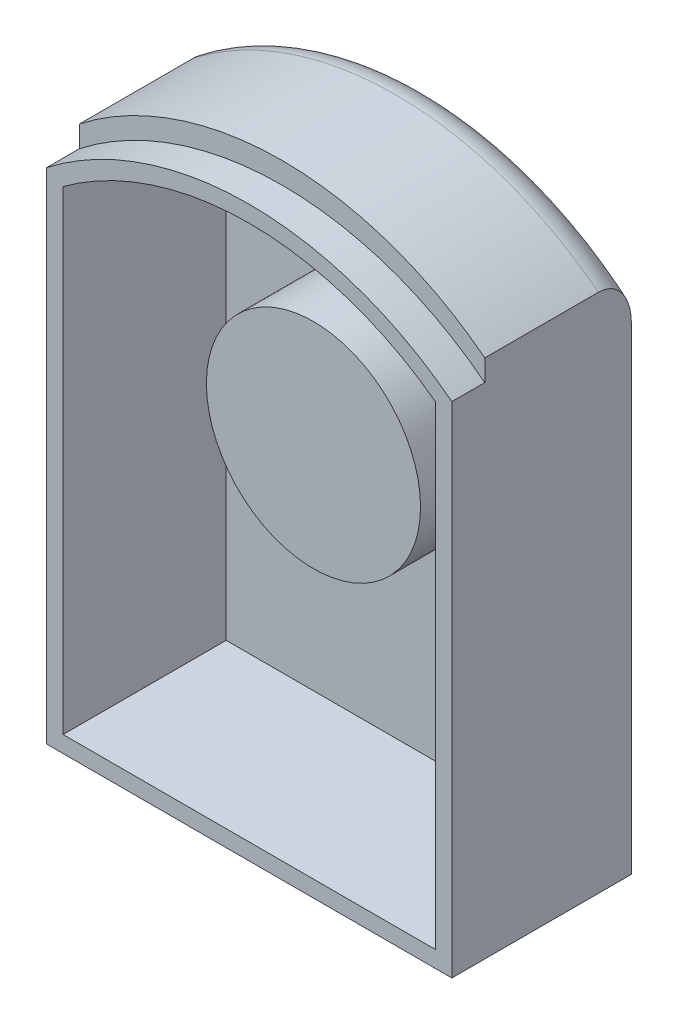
ISO-10303-21;
HEADER;
FILE_DESCRIPTION(('STEP AP214'),'2;1');
FILE_NAME('part.step','',(''),(''),'','','');
FILE_SCHEMA(('AUTOMOTIVE_DESIGN { 1 0 10303 214 1 1 1 1 }'));
ENDSEC;
DATA;
#1=APPLICATION_CONTEXT('core data for automotive mechanical design processes');
#2=APPLICATION_PROTOCOL_DEFINITION('international standard','automotive_design',2000,#1);
#3=PRODUCT_CONTEXT('',#1,'mechanical');
#4=PRODUCT('Part','Part','',(#3));
#5=PRODUCT_RELATED_PRODUCT_CATEGORY('part','',(#4));
#6=PRODUCT_DEFINITION_FORMATION('','',#4);
#7=PRODUCT_DEFINITION_CONTEXT('part definition',#1,'design');
#8=PRODUCT_DEFINITION('design','',#6,#7);
#9=PRODUCT_DEFINITION_SHAPE('','',#8);
#10=(LENGTH_UNIT() NAMED_UNIT(*) SI_UNIT(.MILLI.,.METRE.));
#11=(NAMED_UNIT(*) PLANE_ANGLE_UNIT() SI_UNIT($,.RADIAN.));
#12=(NAMED_UNIT(*) SI_UNIT($,.STERADIAN.) SOLID_ANGLE_UNIT());
#13=UNCERTAINTY_MEASURE_WITH_UNIT(LENGTH_MEASURE(1.E-05),#10,'distance_accuracy_value','');
#14=(GEOMETRIC_REPRESENTATION_CONTEXT(3) GLOBAL_UNCERTAINTY_ASSIGNED_CONTEXT((#13)) GLOBAL_UNIT_ASSIGNED_CONTEXT((#10,
#11,#12)) REPRESENTATION_CONTEXT('',''));
#15=CARTESIAN_POINT('',(0.,0.,0.));
#16=DIRECTION('',(0.,0.,1.));
#17=DIRECTION('',(1.,0.,0.));
#18=AXIS2_PLACEMENT_3D('',#15,#16,#17);
#19=CARTESIAN_POINT('',(0.,14.5294578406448,10.));
#20=DIRECTION('',(0.,0.,-1.));
#21=DIRECTION('',(-1.,0.,0.));
#22=AXIS2_PLACEMENT_3D('',#19,#20,#21);
#23=PLANE('',#22);
#24=CARTESIAN_POINT('',(0.,14.5294578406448,10.));
#25=DIRECTION('',(0.,0.,1.));
#26=DIRECTION('',(-1.,0.,0.));
#27=AXIS2_PLACEMENT_3D('',#24,#25,#26);
#28=CIRCLE('',#27,20.);
#29=CARTESIAN_POINT('',(12.3,30.3,10.));
#30=VERTEX_POINT('',#29);
#31=CARTESIAN_POINT('',(-12.3,30.3,10.));
#32=VERTEX_POINT('',#31);
#33=EDGE_CURVE('E136',#30,#32,#28,.T.);
#34=ORIENTED_EDGE('',*,*,#33,.T.);
#35=DIRECTION('',(0.,-1.,0.));
#36=VECTOR('',#35,1.);
#37=CARTESIAN_POINT('',(-12.3,30.3,10.));
#38=LINE('',#37,#36);
#39=CARTESIAN_POINT('',(-12.3,0.,10.));
#40=VERTEX_POINT('',#39);
#41=EDGE_CURVE('E220',#32,#40,#38,.T.);
#42=ORIENTED_EDGE('',*,*,#41,.T.);
#43=DIRECTION('',(1.,0.,0.));
#44=VECTOR('',#43,1.);
#45=CARTESIAN_POINT('',(-12.3,0.,10.));
#46=LINE('',#45,#44);
#47=CARTESIAN_POINT('',(12.3,0.,10.));
#48=VERTEX_POINT('',#47);
#49=EDGE_CURVE('E223',#40,#48,#46,.T.);
#50=ORIENTED_EDGE('',*,*,#49,.T.);
#51=DIRECTION('',(0.,1.,0.));
#52=VECTOR('',#51,1.);
#53=CARTESIAN_POINT('',(12.3,0.,10.));
#54=LINE('',#53,#52);
#55=EDGE_CURVE('E226',#48,#30,#54,.T.);
#56=ORIENTED_EDGE('',*,*,#55,.T.);
#57=EDGE_LOOP('',(#34,#42,#50,#56));
#58=FACE_BOUND('',#57,.T.);
#59=CARTESIAN_POINT('',(0.,14.5294578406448,10.));
#60=DIRECTION('',(0.,0.,-1.));
#61=DIRECTION('',(-1.,0.,0.));
#62=AXIS2_PLACEMENT_3D('',#59,#60,#61);
#63=CIRCLE('',#62,19.);
#64=CARTESIAN_POINT('',(11.3,29.8039463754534,10.));
#65=VERTEX_POINT('',#64);
#66=CARTESIAN_POINT('',(-11.3,29.8039463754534,10.));
#67=VERTEX_POINT('',#66);
#68=EDGE_CURVE('E132',#65,#67,#63,.F.);
#69=ORIENTED_EDGE('',*,*,#68,.F.);
#70=DIRECTION('',(0.,1.,0.));
#71=VECTOR('',#70,1.);
#72=CARTESIAN_POINT('',(11.3,14.5294578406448,10.));
#73=LINE('',#72,#71);
#74=CARTESIAN_POINT('',(11.3,1.,10.));
#75=VERTEX_POINT('',#74);
#76=EDGE_CURVE('E201',#75,#65,#73,.T.);
#77=ORIENTED_EDGE('',*,*,#76,.F.);
#78=DIRECTION('',(1.,0.,0.));
#79=VECTOR('',#78,1.);
#80=CARTESIAN_POINT('',(0.,1.,10.));
#81=LINE('',#80,#79);
#82=CARTESIAN_POINT('',(-11.3,1.,10.));
#83=VERTEX_POINT('',#82);
#84=EDGE_CURVE('E211',#83,#75,#81,.T.);
#85=ORIENTED_EDGE('',*,*,#84,.F.);
#86=DIRECTION('',(0.,-1.,0.));
#87=VECTOR('',#86,1.);
#88=CARTESIAN_POINT('',(-11.3,14.5294578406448,10.));
#89=LINE('',#88,#87);
#90=EDGE_CURVE('E208',#67,#83,#89,.T.);
#91=ORIENTED_EDGE('',*,*,#90,.F.);
#92=EDGE_LOOP('',(#69,#77,#85,#91));
#93=FACE_BOUND('',#92,.T.);
#94=ADVANCED_FACE('F39',(#58,#93),#23,.F.);
#95=CARTESIAN_POINT('',(0.,14.5294578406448,10.));
#96=DIRECTION('',(0.,0.,-1.));
#97=DIRECTION('',(-1.,0.,0.));
#98=AXIS2_PLACEMENT_3D('',#95,#96,#97);
#99=CYLINDRICAL_SURFACE('',#98,20.);
#100=DIRECTION('',(0.,0.,-1.));
#101=VECTOR('',#100,1.);
#102=CARTESIAN_POINT('',(12.3,30.3,10.));
#103=LINE('',#102,#101);
#104=CARTESIAN_POINT('',(12.3,30.3,8.));
#105=VERTEX_POINT('',#104);
#106=EDGE_CURVE('E229',#30,#105,#103,.T.);
#107=ORIENTED_EDGE('',*,*,#106,.T.);
#108=CARTESIAN_POINT('',(0.,14.5294578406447,8.));
#109=DIRECTION('',(0.,0.,1.));
#110=DIRECTION('',(1.,0.,0.));
#111=AXIS2_PLACEMENT_3D('',#108,#109,#110);
#112=CIRCLE('',#111,20.0000000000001);
#113=CARTESIAN_POINT('',(-12.3,30.3,8.));
#114=VERTEX_POINT('',#113);
#115=EDGE_CURVE('E176',#105,#114,#112,.T.);
#116=ORIENTED_EDGE('',*,*,#115,.T.);
#117=DIRECTION('',(0.,0.,-1.));
#118=VECTOR('',#117,1.);
#119=CARTESIAN_POINT('',(-12.3,30.3,10.));
#120=LINE('',#119,#118);
#121=EDGE_CURVE('E239',#32,#114,#120,.T.);
#122=ORIENTED_EDGE('',*,*,#121,.F.);
#123=ORIENTED_EDGE('',*,*,#33,.F.);
#124=EDGE_LOOP('',(#107,#116,#122,#123));
#125=FACE_BOUND('',#124,.T.);
#126=ADVANCED_FACE('F267',(#125),#99,.T.);
#127=CARTESIAN_POINT('',(-12.3,30.3,10.));
#128=DIRECTION('',(1.,0.,0.));
#129=DIRECTION('',(0.,1.,0.));
#130=AXIS2_PLACEMENT_3D('',#127,#128,#129);
#131=PLANE('',#130);
#132=DIRECTION('',(0.,0.,-1.));
#133=VECTOR('',#132,1.);
#134=CARTESIAN_POINT('',(-12.3,31.6,8.));
#135=LINE('',#134,#133);
#136=CARTESIAN_POINT('',(-12.3,31.6,8.));
#137=VERTEX_POINT('',#136);
#138=CARTESIAN_POINT('',(-12.3,31.6,1.1));
#139=VERTEX_POINT('',#138);
#140=EDGE_CURVE('E191',#137,#139,#135,.T.);
#141=ORIENTED_EDGE('',*,*,#140,.T.);
#142=CARTESIAN_POINT('',(-12.3,31.6,1.1));
#143=CARTESIAN_POINT('',(-12.3,31.6000117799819,1.05240674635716));
#144=CARTESIAN_POINT('',(-12.3,31.5978459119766,1.00481949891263));
#145=CARTESIAN_POINT('',(-12.3,31.5892491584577,0.910053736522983));
#146=CARTESIAN_POINT('',(-12.3,31.5828202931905,0.862875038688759));
#147=CARTESIAN_POINT('',(-12.3,31.5658367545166,0.769547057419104));
#148=CARTESIAN_POINT('',(-12.3,31.5553060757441,0.723393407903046));
#149=CARTESIAN_POINT('',(-12.3,31.5302911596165,0.632180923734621));
#150=CARTESIAN_POINT('',(-12.3,31.5158066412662,0.587122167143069));
#151=CARTESIAN_POINT('',(-12.3,31.4667689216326,0.454192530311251));
#152=CARTESIAN_POINT('',(-12.3,31.4265881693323,0.368336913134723));
#153=CARTESIAN_POINT('',(-12.3,31.3332655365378,0.203986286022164));
#154=CARTESIAN_POINT('',(-12.3,31.2801072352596,0.125500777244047));
#155=CARTESIAN_POINT('',(-12.3,31.1591517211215,-0.0279323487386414));
#156=CARTESIAN_POINT('',(-12.3,31.0906140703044,-0.102293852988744));
#157=CARTESIAN_POINT('',(-12.3,30.943930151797,-0.240707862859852));
#158=CARTESIAN_POINT('',(-12.3,30.8657827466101,-0.304759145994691));
#159=CARTESIAN_POINT('',(-12.3,30.6620539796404,-0.451274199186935));
#160=CARTESIAN_POINT('',(-12.3,30.5319384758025,-0.527464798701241));
#161=CARTESIAN_POINT('',(-12.3,30.2608007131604,-0.657902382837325));
#162=CARTESIAN_POINT('',(-12.3,30.1197367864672,-0.712060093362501));
#163=CARTESIAN_POINT('',(-12.3,29.8123554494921,-0.805255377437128));
#164=CARTESIAN_POINT('',(-12.3,29.6451534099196,-0.841375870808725));
#165=CARTESIAN_POINT('',(-12.3,29.3927220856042,-0.876873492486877));
#166=CARTESIAN_POINT('',(-12.3,29.3086575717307,-0.885594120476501));
#167=CARTESIAN_POINT('',(-12.3,29.1401957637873,-0.897149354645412));
#168=CARTESIAN_POINT('',(-12.3,29.0557988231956,-0.899989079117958));
#169=CARTESIAN_POINT('',(-12.3,28.9713755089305,-0.9));
#170=B_SPLINE_CURVE_WITH_KNOTS('',3,(#142,#143,#144,#145,#146,#147,#148,#149,#150,#151,#152,
#153,#154,#155,#156,#157,#158,#159,#160,#161,#162,#163,#164,#165,#166,#167,#168,#169),
.UNSPECIFIED.,.F.,.F.,(4,2,2,2,2,2,2,2,2,2,2,2,2,4),(0.,0.142720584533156,0.285373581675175,
0.427204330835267,0.569045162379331,0.852029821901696,1.13537442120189,1.43763756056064,
1.73993651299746,2.18979186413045,2.6414522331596,3.15238703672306,3.40576911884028,
3.6589305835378),.UNSPECIFIED.);
#171=CARTESIAN_POINT('',(-12.3,28.9713755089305,-0.9));
#172=VERTEX_POINT('',#171);
#173=EDGE_CURVE('E49',#139,#172,#170,.T.);
#174=ORIENTED_EDGE('',*,*,#173,.T.);
#175=DIRECTION('',(0.,1.,0.));
#176=VECTOR('',#175,1.);
#177=CARTESIAN_POINT('',(-12.3,0.,-0.9));
#178=LINE('',#177,#176);
#179=CARTESIAN_POINT('',(-12.3,0.,-0.9));
#180=VERTEX_POINT('',#179);
#181=EDGE_CURVE('E169',#180,#172,#178,.T.);
#182=ORIENTED_EDGE('',*,*,#181,.F.);
#183=DIRECTION('',(0.,0.,-1.));
#184=VECTOR('',#183,1.);
#185=CARTESIAN_POINT('',(-12.3,0.,10.));
#186=LINE('',#185,#184);
#187=EDGE_CURVE('E236',#40,#180,#186,.T.);
#188=ORIENTED_EDGE('',*,*,#187,.F.);
#189=ORIENTED_EDGE('',*,*,#41,.F.);
#190=ORIENTED_EDGE('',*,*,#121,.T.);
#191=DIRECTION('',(0.,1.,0.));
#192=VECTOR('',#191,1.);
#193=CARTESIAN_POINT('',(-12.3,30.3,8.));
#194=LINE('',#193,#192);
#195=EDGE_CURVE('E179',#114,#137,#194,.T.);
#196=ORIENTED_EDGE('',*,*,#195,.T.);
#197=EDGE_LOOP('',(#141,#174,#182,#188,#189,#190,#196));
#198=FACE_BOUND('',#197,.T.);
#199=ADVANCED_FACE('F263',(#198),#131,.F.);
#200=CARTESIAN_POINT('',(-12.3,0.,10.));
#201=DIRECTION('',(0.,1.,0.));
#202=DIRECTION('',(0.,0.,1.));
#203=AXIS2_PLACEMENT_3D('',#200,#201,#202);
#204=PLANE('',#203);
#205=ORIENTED_EDGE('',*,*,#187,.T.);
#206=DIRECTION('',(-1.,0.,0.));
#207=VECTOR('',#206,1.);
#208=CARTESIAN_POINT('',(12.3,0.,-0.9));
#209=LINE('',#208,#207);
#210=CARTESIAN_POINT('',(12.3,0.,-0.9));
#211=VERTEX_POINT('',#210);
#212=EDGE_CURVE('E165',#211,#180,#209,.T.);
#213=ORIENTED_EDGE('',*,*,#212,.F.);
#214=DIRECTION('',(0.,0.,-1.));
#215=VECTOR('',#214,1.);
#216=CARTESIAN_POINT('',(12.3,0.,10.));
#217=LINE('',#216,#215);
#218=EDGE_CURVE('E232',#48,#211,#217,.T.);
#219=ORIENTED_EDGE('',*,*,#218,.F.);
#220=ORIENTED_EDGE('',*,*,#49,.F.);
#221=EDGE_LOOP('',(#205,#213,#219,#220));
#222=FACE_BOUND('',#221,.T.);
#223=ADVANCED_FACE('F259',(#222),#204,.F.);
#224=CARTESIAN_POINT('',(12.3,0.,10.));
#225=DIRECTION('',(-1.,0.,0.));
#226=DIRECTION('',(0.,-1.,0.));
#227=AXIS2_PLACEMENT_3D('',#224,#225,#226);
#228=PLANE('',#227);
#229=DIRECTION('',(0.,-1.,0.));
#230=VECTOR('',#229,1.);
#231=CARTESIAN_POINT('',(12.3,31.6,-0.9));
#232=LINE('',#231,#230);
#233=CARTESIAN_POINT('',(12.3,28.9713755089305,-0.9));
#234=VERTEX_POINT('',#233);
#235=EDGE_CURVE('E173',#234,#211,#232,.T.);
#236=ORIENTED_EDGE('',*,*,#235,.F.);
#237=CARTESIAN_POINT('',(12.3,28.9713755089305,-0.9));
#238=CARTESIAN_POINT('',(12.3,29.0554954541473,-0.899989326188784));
#239=CARTESIAN_POINT('',(12.3,29.1395892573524,-0.897169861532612));
#240=CARTESIAN_POINT('',(12.3,29.3074481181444,-0.885698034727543));
#241=CARTESIAN_POINT('',(12.3,29.3912128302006,-0.877040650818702));
#242=CARTESIAN_POINT('',(12.3,29.6425381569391,-0.841832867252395));
#243=CARTESIAN_POINT('',(12.3,29.8089508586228,-0.80604047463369));
#244=CARTESIAN_POINT('',(12.3,30.1127598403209,-0.71438497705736));
#245=CARTESIAN_POINT('',(12.3,30.2511224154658,-0.661722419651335));
#246=CARTESIAN_POINT('',(12.3,30.5175442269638,-0.535148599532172));
#247=CARTESIAN_POINT('',(12.3,30.6456323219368,-0.461299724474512));
#248=CARTESIAN_POINT('',(12.3,30.8613247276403,-0.309157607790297));
#249=CARTESIAN_POINT('',(12.3,30.9518148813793,-0.234964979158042));
#250=CARTESIAN_POINT('',(12.3,31.1196164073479,-0.0728186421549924));
#251=CARTESIAN_POINT('',(12.3,31.1969372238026,0.015125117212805));
#252=CARTESIAN_POINT('',(12.3,31.3233725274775,0.188541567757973));
#253=CARTESIAN_POINT('',(12.3,31.3750199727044,0.272163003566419));
#254=CARTESIAN_POINT('',(12.3,31.4636520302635,0.446777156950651));
#255=CARTESIAN_POINT('',(12.3,31.500660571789,0.53775754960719));
#256=CARTESIAN_POINT('',(12.3,31.5524943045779,0.707012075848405));
#257=CARTESIAN_POINT('',(12.3,31.5702032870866,0.784402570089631));
#258=CARTESIAN_POINT('',(12.3,31.588024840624,0.901895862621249));
#259=CARTESIAN_POINT('',(12.3,31.5925085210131,0.941370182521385));
#260=CARTESIAN_POINT('',(12.3,31.5984982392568,1.02055847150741));
#261=CARTESIAN_POINT('',(12.3,31.6000031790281,1.06027252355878));
#262=CARTESIAN_POINT('',(12.3,31.6,1.1));
#263=B_SPLINE_CURVE_WITH_KNOTS('',3,(#237,#238,#239,#240,#241,#242,#243,#244,#245,#246,#247,
#248,#249,#250,#251,#252,#253,#254,#255,#256,#257,#258,#259,#260,#261,#262),.UNSPECIFIED.,.F.,
.F.,(4,2,2,2,2,2,2,2,2,2,2,2,4),(0.,0.252252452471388,0.504722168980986,1.01316806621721,
1.45575041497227,1.89704263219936,2.24678241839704,2.59627032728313,2.88990466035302,
3.18305700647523,3.42033072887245,3.53941472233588,3.65854260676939),.UNSPECIFIED.);
#264=CARTESIAN_POINT('',(12.3,31.6,1.1));
#265=VERTEX_POINT('',#264);
#266=EDGE_CURVE('E64',#234,#265,#263,.T.);
#267=ORIENTED_EDGE('',*,*,#266,.T.);
#268=DIRECTION('',(0.,0.,-1.));
#269=VECTOR('',#268,1.);
#270=CARTESIAN_POINT('',(12.3,31.6,8.));
#271=LINE('',#270,#269);
#272=CARTESIAN_POINT('',(12.3,31.6,8.));
#273=VERTEX_POINT('',#272);
#274=EDGE_CURVE('E192',#273,#265,#271,.T.);
#275=ORIENTED_EDGE('',*,*,#274,.F.);
#276=DIRECTION('',(0.,-1.,0.));
#277=VECTOR('',#276,1.);
#278=CARTESIAN_POINT('',(12.3,30.3,8.));
#279=LINE('',#278,#277);
#280=EDGE_CURVE('E187',#273,#105,#279,.T.);
#281=ORIENTED_EDGE('',*,*,#280,.T.);
#282=ORIENTED_EDGE('',*,*,#106,.F.);
#283=ORIENTED_EDGE('',*,*,#55,.F.);
#284=ORIENTED_EDGE('',*,*,#218,.T.);
#285=EDGE_LOOP('',(#236,#267,#275,#281,#282,#283,#284));
#286=FACE_BOUND('',#285,.T.);
#287=ADVANCED_FACE('F254',(#286),#228,.F.);
#288=CARTESIAN_POINT('',(0.,14.5294578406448,10.));
#289=DIRECTION('',(0.,0.,-1.));
#290=DIRECTION('',(-1.,0.,0.));
#291=AXIS2_PLACEMENT_3D('',#288,#289,#290);
#292=CYLINDRICAL_SURFACE('',#291,19.);
#293=DIRECTION('',(0.,0.,-1.));
#294=VECTOR('',#293,1.);
#295=CARTESIAN_POINT('',(-11.3,29.8039463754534,10.));
#296=LINE('',#295,#294);
#297=CARTESIAN_POINT('',(-11.3,29.8039463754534,0.1));
#298=VERTEX_POINT('',#297);
#299=EDGE_CURVE('E124',#67,#298,#296,.T.);
#300=ORIENTED_EDGE('',*,*,#299,.T.);
#301=CARTESIAN_POINT('',(0.,14.5294578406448,0.1));
#302=DIRECTION('',(0.,0.,1.));
#303=DIRECTION('',(1.,0.,0.));
#304=AXIS2_PLACEMENT_3D('',#301,#302,#303);
#305=CIRCLE('',#304,19.);
#306=CARTESIAN_POINT('',(11.3,29.8039463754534,0.1));
#307=VERTEX_POINT('',#306);
#308=EDGE_CURVE('E129',#307,#298,#305,.T.);
#309=ORIENTED_EDGE('',*,*,#308,.F.);
#310=DIRECTION('',(0.,0.,-1.));
#311=VECTOR('',#310,1.);
#312=CARTESIAN_POINT('',(11.3,29.8039463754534,10.));
#313=LINE('',#312,#311);
#314=EDGE_CURVE('E197',#65,#307,#313,.T.);
#315=ORIENTED_EDGE('',*,*,#314,.F.);
#316=ORIENTED_EDGE('',*,*,#68,.T.);
#317=EDGE_LOOP('',(#300,#309,#315,#316));
#318=FACE_BOUND('',#317,.T.);
#319=ADVANCED_FACE('F126',(#318),#292,.F.);
#320=CARTESIAN_POINT('',(-11.3,30.3,10.));
#321=DIRECTION('',(1.,0.,0.));
#322=DIRECTION('',(0.,1.,0.));
#323=AXIS2_PLACEMENT_3D('',#320,#321,#322);
#324=PLANE('',#323);
#325=DIRECTION('',(0.,0.,-1.));
#326=VECTOR('',#325,1.);
#327=CARTESIAN_POINT('',(-11.3,1.,10.));
#328=LINE('',#327,#326);
#329=CARTESIAN_POINT('',(-11.3,1.,0.1));
#330=VERTEX_POINT('',#329);
#331=EDGE_CURVE('E137',#83,#330,#328,.T.);
#332=ORIENTED_EDGE('',*,*,#331,.T.);
#333=DIRECTION('',(0.,-1.,0.));
#334=VECTOR('',#333,1.);
#335=CARTESIAN_POINT('',(-11.3,29.8039463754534,0.1));
#336=LINE('',#335,#334);
#337=EDGE_CURVE('E140',#298,#330,#336,.T.);
#338=ORIENTED_EDGE('',*,*,#337,.F.);
#339=ORIENTED_EDGE('',*,*,#299,.F.);
#340=ORIENTED_EDGE('',*,*,#90,.T.);
#341=EDGE_LOOP('',(#332,#338,#339,#340));
#342=FACE_BOUND('',#341,.T.);
#343=ADVANCED_FACE('F141',(#342),#324,.T.);
#344=CARTESIAN_POINT('',(-12.3,1.,10.));
#345=DIRECTION('',(0.,1.,0.));
#346=DIRECTION('',(0.,0.,1.));
#347=AXIS2_PLACEMENT_3D('',#344,#345,#346);
#348=PLANE('',#347);
#349=DIRECTION('',(0.,0.,-1.));
#350=VECTOR('',#349,1.);
#351=CARTESIAN_POINT('',(11.3,1.,10.));
#352=LINE('',#351,#350);
#353=CARTESIAN_POINT('',(11.3,1.,0.1));
#354=VERTEX_POINT('',#353);
#355=EDGE_CURVE('E200',#75,#354,#352,.T.);
#356=ORIENTED_EDGE('',*,*,#355,.T.);
#357=DIRECTION('',(1.,0.,0.));
#358=VECTOR('',#357,1.);
#359=CARTESIAN_POINT('',(-11.3,1.,0.1));
#360=LINE('',#359,#358);
#361=EDGE_CURVE('E147',#330,#354,#360,.T.);
#362=ORIENTED_EDGE('',*,*,#361,.F.);
#363=ORIENTED_EDGE('',*,*,#331,.F.);
#364=ORIENTED_EDGE('',*,*,#84,.T.);
#365=EDGE_LOOP('',(#356,#362,#363,#364));
#366=FACE_BOUND('',#365,.T.);
#367=ADVANCED_FACE('F306',(#366),#348,.T.);
#368=CARTESIAN_POINT('',(11.3,0.,10.));
#369=DIRECTION('',(-1.,0.,0.));
#370=DIRECTION('',(0.,-1.,0.));
#371=AXIS2_PLACEMENT_3D('',#368,#369,#370);
#372=PLANE('',#371);
#373=ORIENTED_EDGE('',*,*,#314,.T.);
#374=DIRECTION('',(0.,1.,0.));
#375=VECTOR('',#374,1.);
#376=CARTESIAN_POINT('',(11.3,1.,0.1));
#377=LINE('',#376,#375);
#378=EDGE_CURVE('E151',#354,#307,#377,.T.);
#379=ORIENTED_EDGE('',*,*,#378,.F.);
#380=ORIENTED_EDGE('',*,*,#355,.F.);
#381=ORIENTED_EDGE('',*,*,#76,.T.);
#382=EDGE_LOOP('',(#373,#379,#380,#381));
#383=FACE_BOUND('',#382,.T.);
#384=ADVANCED_FACE('F308',(#383),#372,.T.);
#385=CARTESIAN_POINT('',(0.,15.8294578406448,8.));
#386=DIRECTION('',(0.,0.,-1.));
#387=DIRECTION('',(-1.,0.,0.));
#388=AXIS2_PLACEMENT_3D('',#385,#386,#387);
#389=CYLINDRICAL_SURFACE('',#388,20.);
#390=ORIENTED_EDGE('',*,*,#274,.T.);
#391=CARTESIAN_POINT('',(0.,15.8294578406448,1.1));
#392=DIRECTION('',(0.,0.,-1.));
#393=DIRECTION('',(-1.,0.,0.));
#394=AXIS2_PLACEMENT_3D('',#391,#392,#393);
#395=CIRCLE('',#394,20.);
#396=EDGE_CURVE('E56',#265,#139,#395,.F.);
#397=ORIENTED_EDGE('',*,*,#396,.T.);
#398=ORIENTED_EDGE('',*,*,#140,.F.);
#399=CARTESIAN_POINT('',(0.,15.8294578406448,8.));
#400=DIRECTION('',(0.,0.,-1.));
#401=DIRECTION('',(1.,0.,0.));
#402=AXIS2_PLACEMENT_3D('',#399,#400,#401);
#403=CIRCLE('',#402,20.);
#404=EDGE_CURVE('E183',#137,#273,#403,.T.);
#405=ORIENTED_EDGE('',*,*,#404,.T.);
#406=EDGE_LOOP('',(#390,#397,#398,#405));
#407=FACE_BOUND('',#406,.T.);
#408=ADVANCED_FACE('F310',(#407),#389,.T.);
#409=CARTESIAN_POINT('',(0.,14.5294578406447,8.));
#410=DIRECTION('',(0.,0.,1.));
#411=DIRECTION('',(1.,0.,0.));
#412=AXIS2_PLACEMENT_3D('',#409,#410,#411);
#413=PLANE('',#412);
#414=ORIENTED_EDGE('',*,*,#115,.F.);
#415=ORIENTED_EDGE('',*,*,#280,.F.);
#416=ORIENTED_EDGE('',*,*,#404,.F.);
#417=ORIENTED_EDGE('',*,*,#195,.F.);
#418=EDGE_LOOP('',(#414,#415,#416,#417));
#419=FACE_BOUND('',#418,.T.);
#420=ADVANCED_FACE('F315',(#419),#413,.T.);
#421=CARTESIAN_POINT('',(0.,15.8294578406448,-0.9));
#422=DIRECTION('',(0.,0.,-1.));
#423=DIRECTION('',(-1.,0.,0.));
#424=AXIS2_PLACEMENT_3D('',#421,#422,#423);
#425=PLANE('',#424);
#426=CARTESIAN_POINT('',(0.,19.9147289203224,-0.9));
#427=DIRECTION('',(0.,0.,-1.));
#428=DIRECTION('',(-1.,0.,0.));
#429=AXIS2_PLACEMENT_3D('',#426,#427,#428);
#430=CIRCLE('',#429,5.55);
#431=CARTESIAN_POINT('',(-5.55,19.9147289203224,-0.9));
#432=VERTEX_POINT('',#431);
#433=EDGE_CURVE('E344',#432,#432,#430,.T.);
#434=ORIENTED_EDGE('',*,*,#433,.F.);
#435=EDGE_LOOP('',(#434));
#436=FACE_BOUND('',#435,.T.);
#437=ORIENTED_EDGE('',*,*,#181,.T.);
#438=CARTESIAN_POINT('',(0.,15.8294578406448,-0.9));
#439=DIRECTION('',(0.,0.,-1.));
#440=DIRECTION('',(-1.,0.,0.));
#441=AXIS2_PLACEMENT_3D('',#438,#439,#440);
#442=CIRCLE('',#441,18.);
#443=EDGE_CURVE('E243',#172,#234,#442,.T.);
#444=ORIENTED_EDGE('',*,*,#443,.T.);
#445=ORIENTED_EDGE('',*,*,#235,.T.);
#446=ORIENTED_EDGE('',*,*,#212,.T.);
#447=EDGE_LOOP('',(#437,#444,#445,#446));
#448=FACE_BOUND('',#447,.T.);
#449=ADVANCED_FACE('F281',(#436,#448),#425,.T.);
#450=CARTESIAN_POINT('',(0.,14.5294578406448,0.1));
#451=DIRECTION('',(0.,0.,1.));
#452=DIRECTION('',(1.,0.,0.));
#453=AXIS2_PLACEMENT_3D('',#450,#451,#452);
#454=PLANE('',#453);
#455=CARTESIAN_POINT('',(0.,19.9147289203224,0.1));
#456=DIRECTION('',(0.,0.,1.));
#457=DIRECTION('',(1.,0.,0.));
#458=AXIS2_PLACEMENT_3D('',#455,#456,#457);
#459=CIRCLE('',#458,6.5);
#460=CARTESIAN_POINT('',(6.5,19.9147289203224,0.1));
#461=VERTEX_POINT('',#460);
#462=EDGE_CURVE('E11',#461,#461,#459,.T.);
#463=ORIENTED_EDGE('',*,*,#462,.F.);
#464=EDGE_LOOP('',(#463));
#465=FACE_BOUND('',#464,.T.);
#466=ORIENTED_EDGE('',*,*,#308,.T.);
#467=ORIENTED_EDGE('',*,*,#337,.T.);
#468=ORIENTED_EDGE('',*,*,#361,.T.);
#469=ORIENTED_EDGE('',*,*,#378,.T.);
#470=EDGE_LOOP('',(#466,#467,#468,#469));
#471=FACE_BOUND('',#470,.T.);
#472=ADVANCED_FACE('F149',(#465,#471),#454,.T.);
#473=CARTESIAN_POINT('',(0.,15.8294578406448,1.1));
#474=DIRECTION('',(0.,0.,-1.));
#475=DIRECTION('',(-1.,0.,0.));
#476=AXIS2_PLACEMENT_3D('',#473,#474,#475);
#477=TOROIDAL_SURFACE('',#476,18.,2.);
#478=ORIENTED_EDGE('',*,*,#173,.F.);
#479=ORIENTED_EDGE('',*,*,#396,.F.);
#480=ORIENTED_EDGE('',*,*,#266,.F.);
#481=ORIENTED_EDGE('',*,*,#443,.F.);
#482=EDGE_LOOP('',(#478,#479,#480,#481));
#483=FACE_BOUND('',#482,.T.);
#484=ADVANCED_FACE('F41',(#483),#477,.T.);
#485=CARTESIAN_POINT('',(0.,19.9147289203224,6.1));
#486=DIRECTION('',(0.,0.,-1.));
#487=DIRECTION('',(-1.,0.,0.));
#488=AXIS2_PLACEMENT_3D('',#485,#486,#487);
#489=CYLINDRICAL_SURFACE('',#488,6.5);
#490=ORIENTED_EDGE('',*,*,#462,.T.);
#491=EDGE_LOOP('',(#490));
#492=FACE_BOUND('',#491,.T.);
#493=CARTESIAN_POINT('',(0.,19.9147289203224,6.1));
#494=DIRECTION('',(0.,0.,-1.));
#495=DIRECTION('',(-1.,0.,0.));
#496=AXIS2_PLACEMENT_3D('',#493,#494,#495);
#497=CIRCLE('',#496,6.5);
#498=CARTESIAN_POINT('',(-6.5,19.9147289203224,6.1));
#499=VERTEX_POINT('',#498);
#500=EDGE_CURVE('E153',#499,#499,#497,.T.);
#501=ORIENTED_EDGE('',*,*,#500,.T.);
#502=EDGE_LOOP('',(#501));
#503=FACE_BOUND('',#502,.T.);
#504=ADVANCED_FACE('F284',(#492,#503),#489,.T.);
#505=CARTESIAN_POINT('',(0.,19.9147289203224,6.1));
#506=DIRECTION('',(0.,0.,-1.));
#507=DIRECTION('',(-1.,0.,0.));
#508=AXIS2_PLACEMENT_3D('',#505,#506,#507);
#509=PLANE('',#508);
#510=ORIENTED_EDGE('',*,*,#500,.F.);
#511=EDGE_LOOP('',(#510));
#512=FACE_BOUND('',#511,.T.);
#513=ADVANCED_FACE('F289',(#512),#509,.F.);
#514=CARTESIAN_POINT('',(0.,19.9147289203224,3.3));
#515=DIRECTION('',(0.,0.,-1.));
#516=DIRECTION('',(-1.,0.,0.));
#517=AXIS2_PLACEMENT_3D('',#514,#515,#516);
#518=CYLINDRICAL_SURFACE('',#517,5.55);
#519=CARTESIAN_POINT('',(0.,19.9147289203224,3.3));
#520=DIRECTION('',(0.,0.,-1.));
#521=DIRECTION('',(-1.,0.,0.));
#522=AXIS2_PLACEMENT_3D('',#519,#520,#521);
#523=CIRCLE('',#522,5.55);
#524=CARTESIAN_POINT('',(-5.55,19.9147289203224,3.3));
#525=VERTEX_POINT('',#524);
#526=EDGE_CURVE('E157',#525,#525,#523,.T.);
#527=ORIENTED_EDGE('',*,*,#526,.F.);
#528=EDGE_LOOP('',(#527));
#529=FACE_BOUND('',#528,.T.);
#530=ORIENTED_EDGE('',*,*,#433,.T.);
#531=EDGE_LOOP('',(#530));
#532=FACE_BOUND('',#531,.T.);
#533=ADVANCED_FACE('F331',(#529,#532),#518,.F.);
#534=CARTESIAN_POINT('',(0.,19.9147289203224,3.3));
#535=DIRECTION('',(0.,0.,-1.));
#536=DIRECTION('',(-1.,0.,0.));
#537=AXIS2_PLACEMENT_3D('',#534,#535,#536);
#538=PLANE('',#537);
#539=ORIENTED_EDGE('',*,*,#526,.T.);
#540=EDGE_LOOP('',(#539));
#541=FACE_BOUND('',#540,.T.);
#542=ADVANCED_FACE('F335',(#541),#538,.T.);
#543=CLOSED_SHELL('',(#94,#126,#199,#223,#287,#319,#343,#367,#384,#408,#420,#449,#472,#484,#504,
#513,#533,#542));
#544=MANIFOLD_SOLID_BREP('B2',#543);
#545=ADVANCED_BREP_SHAPE_REPRESENTATION('',(#18,#544),#14);
#546=SHAPE_DEFINITION_REPRESENTATION(#9,#545);
ENDSEC;
END-ISO-10303-21;
